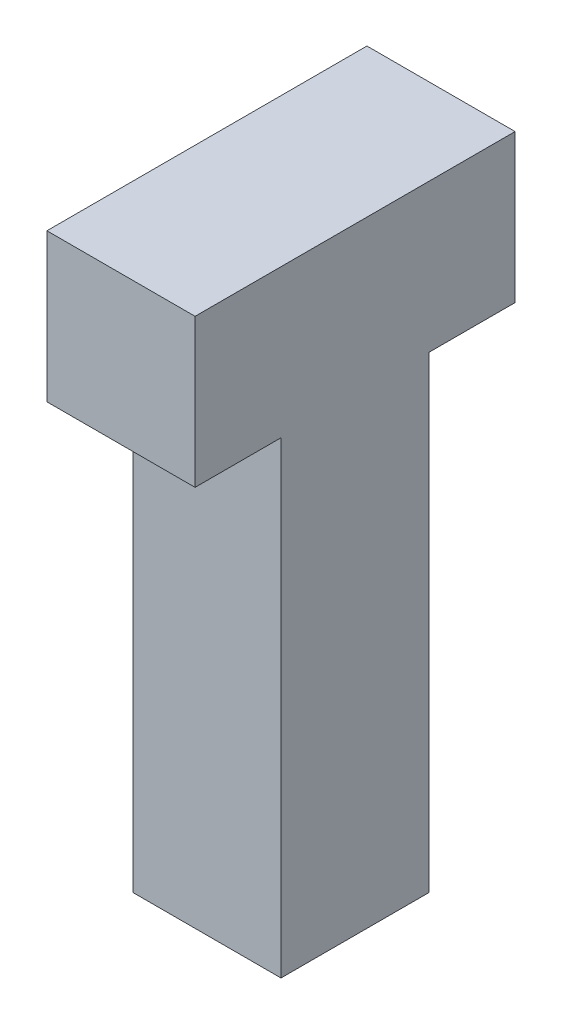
ISO-10303-21;
HEADER;
FILE_DESCRIPTION(('STEP AP214'),'2;1');
FILE_NAME('part.step','',(''),(''),'','','');
FILE_SCHEMA(('AUTOMOTIVE_DESIGN { 1 0 10303 214 1 1 1 1 }'));
ENDSEC;
DATA;
#1=APPLICATION_CONTEXT('core data for automotive mechanical design processes');
#2=APPLICATION_PROTOCOL_DEFINITION('international standard','automotive_design',2000,#1);
#3=PRODUCT_CONTEXT('',#1,'mechanical');
#4=PRODUCT('Part','Part','',(#3));
#5=PRODUCT_RELATED_PRODUCT_CATEGORY('part','',(#4));
#6=PRODUCT_DEFINITION_FORMATION('','',#4);
#7=PRODUCT_DEFINITION_CONTEXT('part definition',#1,'design');
#8=PRODUCT_DEFINITION('design','',#6,#7);
#9=PRODUCT_DEFINITION_SHAPE('','',#8);
#10=(LENGTH_UNIT() NAMED_UNIT(*) SI_UNIT(.MILLI.,.METRE.));
#11=(NAMED_UNIT(*) PLANE_ANGLE_UNIT() SI_UNIT($,.RADIAN.));
#12=(NAMED_UNIT(*) SI_UNIT($,.STERADIAN.) SOLID_ANGLE_UNIT());
#13=UNCERTAINTY_MEASURE_WITH_UNIT(LENGTH_MEASURE(1.E-05),#10,'distance_accuracy_value','');
#14=(GEOMETRIC_REPRESENTATION_CONTEXT(3) GLOBAL_UNCERTAINTY_ASSIGNED_CONTEXT((#13)) GLOBAL_UNIT_ASSIGNED_CONTEXT((#10,
#11,#12)) REPRESENTATION_CONTEXT('',''));
#15=CARTESIAN_POINT('',(0.,0.,0.));
#16=DIRECTION('',(0.,0.,1.));
#17=DIRECTION('',(1.,0.,0.));
#18=AXIS2_PLACEMENT_3D('',#15,#16,#17);
#19=CARTESIAN_POINT('',(0.,-9.5,20.52));
#20=DIRECTION('',(0.,1.,0.));
#21=DIRECTION('',(0.,0.,1.));
#22=AXIS2_PLACEMENT_3D('',#19,#20,#21);
#23=PLANE('',#22);
#24=DIRECTION('',(-1.,0.,0.));
#25=VECTOR('',#24,1.);
#26=CARTESIAN_POINT('',(0.,-9.5,15.01));
#27=LINE('',#26,#25);
#28=CARTESIAN_POINT('',(9.5,-9.5,15.01));
#29=VERTEX_POINT('',#28);
#30=CARTESIAN_POINT('',(0.,-9.5,15.01));
#31=VERTEX_POINT('',#30);
#32=EDGE_CURVE('E124',#29,#31,#27,.T.);
#33=ORIENTED_EDGE('',*,*,#32,.F.);
#34=DIRECTION('',(0.,0.,-1.));
#35=VECTOR('',#34,1.);
#36=CARTESIAN_POINT('',(9.5,-9.5,20.52));
#37=LINE('',#36,#35);
#38=CARTESIAN_POINT('',(9.5,-9.5,20.52));
#39=VERTEX_POINT('',#38);
#40=EDGE_CURVE('E168',#39,#29,#37,.T.);
#41=ORIENTED_EDGE('',*,*,#40,.F.);
#42=DIRECTION('',(1.,0.,0.));
#43=VECTOR('',#42,1.);
#44=CARTESIAN_POINT('',(0.,-9.5,20.52));
#45=LINE('',#44,#43);
#46=CARTESIAN_POINT('',(0.,-9.5,20.52));
#47=VERTEX_POINT('',#46);
#48=EDGE_CURVE('E142',#47,#39,#45,.T.);
#49=ORIENTED_EDGE('',*,*,#48,.F.);
#50=DIRECTION('',(0.,0.,-1.));
#51=VECTOR('',#50,1.);
#52=CARTESIAN_POINT('',(0.,-9.5,20.52));
#53=LINE('',#52,#51);
#54=EDGE_CURVE('E11',#47,#31,#53,.T.);
#55=ORIENTED_EDGE('',*,*,#54,.T.);
#56=EDGE_LOOP('',(#33,#41,#49,#55));
#57=FACE_BOUND('',#56,.T.);
#58=ADVANCED_FACE('F39',(#57),#23,.F.);
#59=DIRECTION('',(1.,0.,0.));
#60=VECTOR('',#59,1.);
#61=CARTESIAN_POINT('',(0.,-9.5,5.51));
#62=LINE('',#61,#60);
#63=CARTESIAN_POINT('',(0.,-9.5,5.51));
#64=VERTEX_POINT('',#63);
#65=CARTESIAN_POINT('',(9.5,-9.5,5.51));
#66=VERTEX_POINT('',#65);
#67=EDGE_CURVE('E55',#64,#66,#62,.T.);
#68=ORIENTED_EDGE('',*,*,#67,.F.);
#69=CARTESIAN_POINT('',(0.,-9.5,0.));
#70=VERTEX_POINT('',#69);
#71=EDGE_CURVE('E48',#64,#70,#53,.T.);
#72=ORIENTED_EDGE('',*,*,#71,.T.);
#73=DIRECTION('',(1.,0.,0.));
#74=VECTOR('',#73,1.);
#75=CARTESIAN_POINT('',(0.,-9.5,0.));
#76=LINE('',#75,#74);
#77=CARTESIAN_POINT('',(9.5,-9.5,0.));
#78=VERTEX_POINT('',#77);
#79=EDGE_CURVE('E132',#70,#78,#76,.T.);
#80=ORIENTED_EDGE('',*,*,#79,.T.);
#81=EDGE_CURVE('E167',#66,#78,#37,.T.);
#82=ORIENTED_EDGE('',*,*,#81,.F.);
#83=EDGE_LOOP('',(#68,#72,#80,#82));
#84=FACE_BOUND('',#83,.T.);
#85=ADVANCED_FACE('F182',(#84),#23,.F.);
#86=CARTESIAN_POINT('',(0.,0.,20.52));
#87=DIRECTION('',(1.,0.,0.));
#88=DIRECTION('',(0.,1.,0.));
#89=AXIS2_PLACEMENT_3D('',#86,#87,#88);
#90=PLANE('',#89);
#91=DIRECTION('',(0.,-1.,0.));
#92=VECTOR('',#91,1.);
#93=CARTESIAN_POINT('',(0.,0.,0.));
#94=LINE('',#93,#92);
#95=CARTESIAN_POINT('',(0.,0.,0.));
#96=VERTEX_POINT('',#95);
#97=EDGE_CURVE('E128',#96,#70,#94,.T.);
#98=ORIENTED_EDGE('',*,*,#97,.T.);
#99=ORIENTED_EDGE('',*,*,#71,.F.);
#100=DIRECTION('',(0.,1.,0.));
#101=VECTOR('',#100,1.);
#102=CARTESIAN_POINT('',(0.,-39.5,5.51));
#103=LINE('',#102,#101);
#104=CARTESIAN_POINT('',(0.,-39.5,5.51));
#105=VERTEX_POINT('',#104);
#106=EDGE_CURVE('E107',#105,#64,#103,.T.);
#107=ORIENTED_EDGE('',*,*,#106,.F.);
#108=DIRECTION('',(0.,0.,-1.));
#109=VECTOR('',#108,1.);
#110=CARTESIAN_POINT('',(0.,-39.5,15.01));
#111=LINE('',#110,#109);
#112=CARTESIAN_POINT('',(0.,-39.5,15.01));
#113=VERTEX_POINT('',#112);
#114=EDGE_CURVE('E114',#113,#105,#111,.T.);
#115=ORIENTED_EDGE('',*,*,#114,.F.);
#116=DIRECTION('',(0.,1.,0.));
#117=VECTOR('',#116,1.);
#118=CARTESIAN_POINT('',(0.,-39.5,15.01));
#119=LINE('',#118,#117);
#120=EDGE_CURVE('E201',#113,#31,#119,.T.);
#121=ORIENTED_EDGE('',*,*,#120,.T.);
#122=ORIENTED_EDGE('',*,*,#54,.F.);
#123=DIRECTION('',(0.,-1.,0.));
#124=VECTOR('',#123,1.);
#125=CARTESIAN_POINT('',(0.,0.,20.52));
#126=LINE('',#125,#124);
#127=CARTESIAN_POINT('',(0.,0.,20.52));
#128=VERTEX_POINT('',#127);
#129=EDGE_CURVE('E138',#128,#47,#126,.T.);
#130=ORIENTED_EDGE('',*,*,#129,.F.);
#131=DIRECTION('',(0.,0.,-1.));
#132=VECTOR('',#131,1.);
#133=CARTESIAN_POINT('',(0.,0.,20.52));
#134=LINE('',#133,#132);
#135=EDGE_CURVE('E151',#128,#96,#134,.T.);
#136=ORIENTED_EDGE('',*,*,#135,.T.);
#137=EDGE_LOOP('',(#98,#99,#107,#115,#121,#122,#130,#136));
#138=FACE_BOUND('',#137,.T.);
#139=ADVANCED_FACE('F41',(#138),#90,.F.);
#140=CARTESIAN_POINT('',(9.5,0.,20.52));
#141=DIRECTION('',(-1.,0.,0.));
#142=DIRECTION('',(0.,-1.,0.));
#143=AXIS2_PLACEMENT_3D('',#140,#141,#142);
#144=PLANE('',#143);
#145=DIRECTION('',(0.,1.,0.));
#146=VECTOR('',#145,1.);
#147=CARTESIAN_POINT('',(9.5,0.,0.));
#148=LINE('',#147,#146);
#149=CARTESIAN_POINT('',(9.5,0.,0.));
#150=VERTEX_POINT('',#149);
#151=EDGE_CURVE('E156',#78,#150,#148,.T.);
#152=ORIENTED_EDGE('',*,*,#151,.T.);
#153=DIRECTION('',(0.,0.,-1.));
#154=VECTOR('',#153,1.);
#155=CARTESIAN_POINT('',(9.5,0.,20.52));
#156=LINE('',#155,#154);
#157=CARTESIAN_POINT('',(9.5,0.,20.52));
#158=VERTEX_POINT('',#157);
#159=EDGE_CURVE('E164',#158,#150,#156,.T.);
#160=ORIENTED_EDGE('',*,*,#159,.F.);
#161=DIRECTION('',(0.,1.,0.));
#162=VECTOR('',#161,1.);
#163=CARTESIAN_POINT('',(9.5,0.,20.52));
#164=LINE('',#163,#162);
#165=EDGE_CURVE('E146',#39,#158,#164,.T.);
#166=ORIENTED_EDGE('',*,*,#165,.F.);
#167=ORIENTED_EDGE('',*,*,#40,.T.);
#168=DIRECTION('',(0.,1.,0.));
#169=VECTOR('',#168,1.);
#170=CARTESIAN_POINT('',(9.5,-39.5,15.01));
#171=LINE('',#170,#169);
#172=CARTESIAN_POINT('',(9.5,-39.5,15.01));
#173=VERTEX_POINT('',#172);
#174=EDGE_CURVE('E134',#173,#29,#171,.T.);
#175=ORIENTED_EDGE('',*,*,#174,.F.);
#176=DIRECTION('',(0.,0.,1.));
#177=VECTOR('',#176,1.);
#178=CARTESIAN_POINT('',(9.5,-39.5,15.01));
#179=LINE('',#178,#177);
#180=CARTESIAN_POINT('',(9.5,-39.5,5.51));
#181=VERTEX_POINT('',#180);
#182=EDGE_CURVE('E113',#181,#173,#179,.T.);
#183=ORIENTED_EDGE('',*,*,#182,.F.);
#184=DIRECTION('',(0.,1.,0.));
#185=VECTOR('',#184,1.);
#186=CARTESIAN_POINT('',(9.5,-39.5,5.51));
#187=LINE('',#186,#185);
#188=EDGE_CURVE('E109',#181,#66,#187,.T.);
#189=ORIENTED_EDGE('',*,*,#188,.T.);
#190=ORIENTED_EDGE('',*,*,#81,.T.);
#191=EDGE_LOOP('',(#152,#160,#166,#167,#175,#183,#189,#190));
#192=FACE_BOUND('',#191,.T.);
#193=ADVANCED_FACE('F178',(#192),#144,.F.);
#194=CARTESIAN_POINT('',(0.,0.,20.52));
#195=DIRECTION('',(0.,-1.,0.));
#196=DIRECTION('',(0.,0.,-1.));
#197=AXIS2_PLACEMENT_3D('',#194,#195,#196);
#198=PLANE('',#197);
#199=DIRECTION('',(-1.,0.,0.));
#200=VECTOR('',#199,1.);
#201=CARTESIAN_POINT('',(0.,0.,0.));
#202=LINE('',#201,#200);
#203=EDGE_CURVE('E143',#150,#96,#202,.T.);
#204=ORIENTED_EDGE('',*,*,#203,.T.);
#205=ORIENTED_EDGE('',*,*,#135,.F.);
#206=DIRECTION('',(-1.,0.,0.));
#207=VECTOR('',#206,1.);
#208=CARTESIAN_POINT('',(0.,0.,20.52));
#209=LINE('',#208,#207);
#210=EDGE_CURVE('E149',#158,#128,#209,.T.);
#211=ORIENTED_EDGE('',*,*,#210,.F.);
#212=ORIENTED_EDGE('',*,*,#159,.T.);
#213=EDGE_LOOP('',(#204,#205,#211,#212));
#214=FACE_BOUND('',#213,.T.);
#215=ADVANCED_FACE('F189',(#214),#198,.F.);
#216=CARTESIAN_POINT('',(0.,0.,20.52));
#217=DIRECTION('',(0.,0.,1.));
#218=DIRECTION('',(1.,0.,0.));
#219=AXIS2_PLACEMENT_3D('',#216,#217,#218);
#220=PLANE('',#219);
#221=ORIENTED_EDGE('',*,*,#129,.T.);
#222=ORIENTED_EDGE('',*,*,#48,.T.);
#223=ORIENTED_EDGE('',*,*,#165,.T.);
#224=ORIENTED_EDGE('',*,*,#210,.T.);
#225=EDGE_LOOP('',(#221,#222,#223,#224));
#226=FACE_BOUND('',#225,.T.);
#227=ADVANCED_FACE('F193',(#226),#220,.T.);
#228=CARTESIAN_POINT('',(0.,0.,0.));
#229=DIRECTION('',(0.,0.,1.));
#230=DIRECTION('',(1.,0.,0.));
#231=AXIS2_PLACEMENT_3D('',#228,#229,#230);
#232=PLANE('',#231);
#233=ORIENTED_EDGE('',*,*,#97,.F.);
#234=ORIENTED_EDGE('',*,*,#203,.F.);
#235=ORIENTED_EDGE('',*,*,#151,.F.);
#236=ORIENTED_EDGE('',*,*,#79,.F.);
#237=EDGE_LOOP('',(#233,#234,#235,#236));
#238=FACE_BOUND('',#237,.T.);
#239=ADVANCED_FACE('F186',(#238),#232,.F.);
#240=CARTESIAN_POINT('',(0.,-39.5,5.51));
#241=DIRECTION('',(0.,0.,1.));
#242=DIRECTION('',(1.,0.,0.));
#243=AXIS2_PLACEMENT_3D('',#240,#241,#242);
#244=PLANE('',#243);
#245=ORIENTED_EDGE('',*,*,#67,.T.);
#246=ORIENTED_EDGE('',*,*,#188,.F.);
#247=DIRECTION('',(1.,0.,0.));
#248=VECTOR('',#247,1.);
#249=CARTESIAN_POINT('',(0.,-39.5,5.51));
#250=LINE('',#249,#248);
#251=EDGE_CURVE('E103',#105,#181,#250,.T.);
#252=ORIENTED_EDGE('',*,*,#251,.F.);
#253=ORIENTED_EDGE('',*,*,#106,.T.);
#254=EDGE_LOOP('',(#245,#246,#252,#253));
#255=FACE_BOUND('',#254,.T.);
#256=ADVANCED_FACE('F105',(#255),#244,.F.);
#257=CARTESIAN_POINT('',(0.,-39.5,15.01));
#258=DIRECTION('',(0.,0.,-1.));
#259=DIRECTION('',(-1.,0.,0.));
#260=AXIS2_PLACEMENT_3D('',#257,#258,#259);
#261=PLANE('',#260);
#262=ORIENTED_EDGE('',*,*,#32,.T.);
#263=ORIENTED_EDGE('',*,*,#120,.F.);
#264=DIRECTION('',(-1.,0.,0.));
#265=VECTOR('',#264,1.);
#266=CARTESIAN_POINT('',(0.,-39.5,15.01));
#267=LINE('',#266,#265);
#268=EDGE_CURVE('E119',#173,#113,#267,.T.);
#269=ORIENTED_EDGE('',*,*,#268,.F.);
#270=ORIENTED_EDGE('',*,*,#174,.T.);
#271=EDGE_LOOP('',(#262,#263,#269,#270));
#272=FACE_BOUND('',#271,.T.);
#273=ADVANCED_FACE('F204',(#272),#261,.F.);
#274=CARTESIAN_POINT('',(0.,-39.5,0.));
#275=DIRECTION('',(0.,-1.,0.));
#276=DIRECTION('',(0.,0.,-1.));
#277=AXIS2_PLACEMENT_3D('',#274,#275,#276);
#278=PLANE('',#277);
#279=ORIENTED_EDGE('',*,*,#114,.T.);
#280=ORIENTED_EDGE('',*,*,#251,.T.);
#281=ORIENTED_EDGE('',*,*,#182,.T.);
#282=ORIENTED_EDGE('',*,*,#268,.T.);
#283=EDGE_LOOP('',(#279,#280,#281,#282));
#284=FACE_BOUND('',#283,.T.);
#285=ADVANCED_FACE('F117',(#284),#278,.T.);
#286=CLOSED_SHELL('',(#58,#85,#139,#193,#215,#227,#239,#256,#273,#285));
#287=MANIFOLD_SOLID_BREP('B2',#286);
#288=ADVANCED_BREP_SHAPE_REPRESENTATION('',(#18,#287),#14);
#289=SHAPE_DEFINITION_REPRESENTATION(#9,#288);
ENDSEC;
END-ISO-10303-21;
